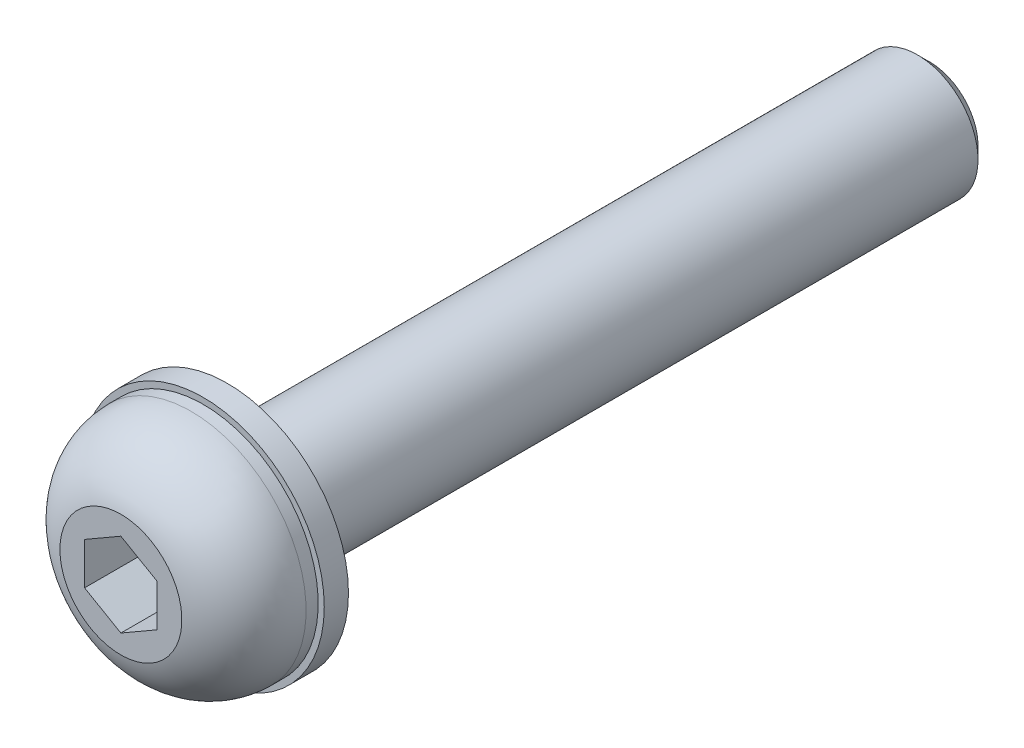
ISO-10303-21;
HEADER;
FILE_DESCRIPTION(('STEP AP214'),'2;1');
FILE_NAME('part.step','',(''),(''),'','','');
FILE_SCHEMA(('AUTOMOTIVE_DESIGN { 1 0 10303 214 1 1 1 1 }'));
ENDSEC;
DATA;
#1=APPLICATION_CONTEXT('core data for automotive mechanical design processes');
#2=APPLICATION_PROTOCOL_DEFINITION('international standard','automotive_design',2000,#1);
#3=PRODUCT_CONTEXT('',#1,'mechanical');
#4=PRODUCT('Part','Part','',(#3));
#5=PRODUCT_RELATED_PRODUCT_CATEGORY('part','',(#4));
#6=PRODUCT_DEFINITION_FORMATION('','',#4);
#7=PRODUCT_DEFINITION_CONTEXT('part definition',#1,'design');
#8=PRODUCT_DEFINITION('design','',#6,#7);
#9=PRODUCT_DEFINITION_SHAPE('','',#8);
#10=(LENGTH_UNIT() NAMED_UNIT(*) SI_UNIT(.MILLI.,.METRE.));
#11=(NAMED_UNIT(*) PLANE_ANGLE_UNIT() SI_UNIT($,.RADIAN.));
#12=(NAMED_UNIT(*) SI_UNIT($,.STERADIAN.) SOLID_ANGLE_UNIT());
#13=UNCERTAINTY_MEASURE_WITH_UNIT(LENGTH_MEASURE(1.E-05),#10,'distance_accuracy_value','');
#14=(GEOMETRIC_REPRESENTATION_CONTEXT(3) GLOBAL_UNCERTAINTY_ASSIGNED_CONTEXT((#13)) GLOBAL_UNIT_ASSIGNED_CONTEXT((#10,
#11,#12)) REPRESENTATION_CONTEXT('',''));
#15=CARTESIAN_POINT('',(0.,0.,0.));
#16=DIRECTION('',(0.,0.,1.));
#17=DIRECTION('',(1.,0.,0.));
#18=AXIS2_PLACEMENT_3D('',#15,#16,#17);
#19=CARTESIAN_POINT('',(0.,-1.73205080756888,1.4));
#20=DIRECTION('',(0.,0.,1.));
#21=DIRECTION('',(-1.,0.,0.));
#22=AXIS2_PLACEMENT_3D('',#19,#20,#21);
#23=PLANE('',#22);
#24=DIRECTION('',(0.86602540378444,-0.5,0.));
#25=VECTOR('',#24,1.);
#26=CARTESIAN_POINT('',(-1.5,-0.866025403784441,1.4));
#27=LINE('',#26,#25);
#28=CARTESIAN_POINT('',(-1.5,-0.866025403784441,1.4));
#29=VERTEX_POINT('',#28);
#30=CARTESIAN_POINT('',(0.,-1.73205080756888,1.4));
#31=VERTEX_POINT('',#30);
#32=EDGE_CURVE('E116',#29,#31,#27,.T.);
#33=ORIENTED_EDGE('',*,*,#32,.T.);
#34=DIRECTION('',(0.86602540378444,0.5,0.));
#35=VECTOR('',#34,1.);
#36=CARTESIAN_POINT('',(0.,-1.73205080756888,1.4));
#37=LINE('',#36,#35);
#38=CARTESIAN_POINT('',(1.5,-0.86602540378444,1.4));
#39=VERTEX_POINT('',#38);
#40=EDGE_CURVE('E98',#31,#39,#37,.T.);
#41=ORIENTED_EDGE('',*,*,#40,.T.);
#42=DIRECTION('',(0.,1.,0.));
#43=VECTOR('',#42,1.);
#44=CARTESIAN_POINT('',(1.5,-0.86602540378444,1.4));
#45=LINE('',#44,#43);
#46=CARTESIAN_POINT('',(1.5,0.86602540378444,1.4));
#47=VERTEX_POINT('',#46);
#48=EDGE_CURVE('E96',#39,#47,#45,.T.);
#49=ORIENTED_EDGE('',*,*,#48,.T.);
#50=DIRECTION('',(-0.86602540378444,0.5,0.));
#51=VECTOR('',#50,1.);
#52=CARTESIAN_POINT('',(1.5,0.86602540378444,1.4));
#53=LINE('',#52,#51);
#54=CARTESIAN_POINT('',(0.,1.73205080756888,1.4));
#55=VERTEX_POINT('',#54);
#56=EDGE_CURVE('E76',#47,#55,#53,.T.);
#57=ORIENTED_EDGE('',*,*,#56,.T.);
#58=DIRECTION('',(-0.86602540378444,-0.5,0.));
#59=VECTOR('',#58,1.);
#60=CARTESIAN_POINT('',(0.,1.73205080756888,1.4));
#61=LINE('',#60,#59);
#62=CARTESIAN_POINT('',(-1.5,0.86602540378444,1.4));
#63=VERTEX_POINT('',#62);
#64=EDGE_CURVE('E87',#55,#63,#61,.T.);
#65=ORIENTED_EDGE('',*,*,#64,.T.);
#66=DIRECTION('',(0.,-1.,0.));
#67=VECTOR('',#66,1.);
#68=CARTESIAN_POINT('',(-1.5,0.86602540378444,1.4));
#69=LINE('',#68,#67);
#70=EDGE_CURVE('E91',#63,#29,#69,.T.);
#71=ORIENTED_EDGE('',*,*,#70,.T.);
#72=EDGE_LOOP('',(#33,#41,#49,#57,#65,#71));
#73=FACE_BOUND('',#72,.T.);
#74=ADVANCED_FACE('F14',(#73),#23,.T.);
#75=CARTESIAN_POINT('',(1.5,-0.86602540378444,1.4));
#76=DIRECTION('',(1.,0.,0.));
#77=DIRECTION('',(0.,1.,0.));
#78=AXIS2_PLACEMENT_3D('',#75,#76,#77);
#79=PLANE('',#78);
#80=DIRECTION('',(0.,1.,0.));
#81=VECTOR('',#80,1.);
#82=CARTESIAN_POINT('',(1.5,-0.86602540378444,4.4));
#83=LINE('',#82,#81);
#84=CARTESIAN_POINT('',(1.5,-0.86602540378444,4.4));
#85=VERTEX_POINT('',#84);
#86=CARTESIAN_POINT('',(1.5,0.86602540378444,4.4));
#87=VERTEX_POINT('',#86);
#88=EDGE_CURVE('E108',#85,#87,#83,.T.);
#89=ORIENTED_EDGE('',*,*,#88,.T.);
#90=DIRECTION('',(0.,0.,1.));
#91=VECTOR('',#90,1.);
#92=CARTESIAN_POINT('',(1.5,0.86602540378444,1.4));
#93=LINE('',#92,#91);
#94=EDGE_CURVE('E84',#47,#87,#93,.T.);
#95=ORIENTED_EDGE('',*,*,#94,.F.);
#96=ORIENTED_EDGE('',*,*,#48,.F.);
#97=DIRECTION('',(0.,0.,1.));
#98=VECTOR('',#97,1.);
#99=CARTESIAN_POINT('',(1.5,-0.86602540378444,1.4));
#100=LINE('',#99,#98);
#101=EDGE_CURVE('E121',#39,#85,#100,.T.);
#102=ORIENTED_EDGE('',*,*,#101,.T.);
#103=EDGE_LOOP('',(#89,#95,#96,#102));
#104=FACE_BOUND('',#103,.T.);
#105=ADVANCED_FACE('F176',(#104),#79,.F.);
#106=CARTESIAN_POINT('',(1.5,0.86602540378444,1.4));
#107=DIRECTION('',(0.5,0.86602540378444,0.));
#108=DIRECTION('',(-0.86602540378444,0.5,0.));
#109=AXIS2_PLACEMENT_3D('',#106,#107,#108);
#110=PLANE('',#109);
#111=DIRECTION('',(-0.86602540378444,0.5,0.));
#112=VECTOR('',#111,1.);
#113=CARTESIAN_POINT('',(1.5,0.86602540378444,4.4));
#114=LINE('',#113,#112);
#115=CARTESIAN_POINT('',(0.,1.73205080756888,4.4));
#116=VERTEX_POINT('',#115);
#117=EDGE_CURVE('E79',#87,#116,#114,.T.);
#118=ORIENTED_EDGE('',*,*,#117,.T.);
#119=DIRECTION('',(0.,0.,1.));
#120=VECTOR('',#119,1.);
#121=CARTESIAN_POINT('',(0.,1.73205080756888,1.4));
#122=LINE('',#121,#120);
#123=EDGE_CURVE('E72',#55,#116,#122,.T.);
#124=ORIENTED_EDGE('',*,*,#123,.F.);
#125=ORIENTED_EDGE('',*,*,#56,.F.);
#126=ORIENTED_EDGE('',*,*,#94,.T.);
#127=EDGE_LOOP('',(#118,#124,#125,#126));
#128=FACE_BOUND('',#127,.T.);
#129=ADVANCED_FACE('F74',(#128),#110,.F.);
#130=CARTESIAN_POINT('',(0.,1.73205080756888,1.4));
#131=DIRECTION('',(-0.5,0.86602540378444,0.));
#132=DIRECTION('',(-0.86602540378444,-0.5,0.));
#133=AXIS2_PLACEMENT_3D('',#130,#131,#132);
#134=PLANE('',#133);
#135=DIRECTION('',(-0.86602540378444,-0.5,0.));
#136=VECTOR('',#135,1.);
#137=CARTESIAN_POINT('',(0.,1.73205080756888,4.4));
#138=LINE('',#137,#136);
#139=CARTESIAN_POINT('',(-1.5,0.86602540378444,4.4));
#140=VERTEX_POINT('',#139);
#141=EDGE_CURVE('E112',#116,#140,#138,.T.);
#142=ORIENTED_EDGE('',*,*,#141,.T.);
#143=DIRECTION('',(0.,0.,1.));
#144=VECTOR('',#143,1.);
#145=CARTESIAN_POINT('',(-1.5,0.86602540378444,1.4));
#146=LINE('',#145,#144);
#147=EDGE_CURVE('E83',#63,#140,#146,.T.);
#148=ORIENTED_EDGE('',*,*,#147,.F.);
#149=ORIENTED_EDGE('',*,*,#64,.F.);
#150=ORIENTED_EDGE('',*,*,#123,.T.);
#151=EDGE_LOOP('',(#142,#148,#149,#150));
#152=FACE_BOUND('',#151,.T.);
#153=ADVANCED_FACE('F88',(#152),#134,.F.);
#154=CARTESIAN_POINT('',(-1.5,0.86602540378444,1.4));
#155=DIRECTION('',(-1.,0.,0.));
#156=DIRECTION('',(0.,-1.,0.));
#157=AXIS2_PLACEMENT_3D('',#154,#155,#156);
#158=PLANE('',#157);
#159=DIRECTION('',(0.,-1.,0.));
#160=VECTOR('',#159,1.);
#161=CARTESIAN_POINT('',(-1.5,0.86602540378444,4.4));
#162=LINE('',#161,#160);
#163=CARTESIAN_POINT('',(-1.5,-0.866025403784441,4.4));
#164=VERTEX_POINT('',#163);
#165=EDGE_CURVE('E114',#140,#164,#162,.T.);
#166=ORIENTED_EDGE('',*,*,#165,.T.);
#167=DIRECTION('',(0.,0.,1.));
#168=VECTOR('',#167,1.);
#169=CARTESIAN_POINT('',(-1.5,-0.866025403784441,1.4));
#170=LINE('',#169,#168);
#171=EDGE_CURVE('E39',#29,#164,#170,.T.);
#172=ORIENTED_EDGE('',*,*,#171,.F.);
#173=ORIENTED_EDGE('',*,*,#70,.F.);
#174=ORIENTED_EDGE('',*,*,#147,.T.);
#175=EDGE_LOOP('',(#166,#172,#173,#174));
#176=FACE_BOUND('',#175,.T.);
#177=ADVANCED_FACE('F185',(#176),#158,.F.);
#178=CARTESIAN_POINT('',(-1.5,-0.866025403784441,1.4));
#179=DIRECTION('',(-0.5,-0.86602540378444,0.));
#180=DIRECTION('',(0.866025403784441,-0.5,0.));
#181=AXIS2_PLACEMENT_3D('',#178,#179,#180);
#182=PLANE('',#181);
#183=DIRECTION('',(0.86602540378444,-0.5,0.));
#184=VECTOR('',#183,1.);
#185=CARTESIAN_POINT('',(-1.5,-0.866025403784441,4.4));
#186=LINE('',#185,#184);
#187=CARTESIAN_POINT('',(0.,-1.73205080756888,4.4));
#188=VERTEX_POINT('',#187);
#189=EDGE_CURVE('E31',#164,#188,#186,.T.);
#190=ORIENTED_EDGE('',*,*,#189,.T.);
#191=DIRECTION('',(0.,0.,1.));
#192=VECTOR('',#191,1.);
#193=CARTESIAN_POINT('',(0.,-1.73205080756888,1.4));
#194=LINE('',#193,#192);
#195=EDGE_CURVE('E61',#31,#188,#194,.T.);
#196=ORIENTED_EDGE('',*,*,#195,.F.);
#197=ORIENTED_EDGE('',*,*,#32,.F.);
#198=ORIENTED_EDGE('',*,*,#171,.T.);
#199=EDGE_LOOP('',(#190,#196,#197,#198));
#200=FACE_BOUND('',#199,.T.);
#201=ADVANCED_FACE('F188',(#200),#182,.F.);
#202=CARTESIAN_POINT('',(0.,-1.73205080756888,1.4));
#203=DIRECTION('',(0.5,-0.86602540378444,0.));
#204=DIRECTION('',(0.86602540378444,0.5,0.));
#205=AXIS2_PLACEMENT_3D('',#202,#203,#204);
#206=PLANE('',#205);
#207=DIRECTION('',(0.86602540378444,0.5,0.));
#208=VECTOR('',#207,1.);
#209=CARTESIAN_POINT('',(0.,-1.73205080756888,4.4));
#210=LINE('',#209,#208);
#211=EDGE_CURVE('E104',#188,#85,#210,.T.);
#212=ORIENTED_EDGE('',*,*,#211,.T.);
#213=ORIENTED_EDGE('',*,*,#101,.F.);
#214=ORIENTED_EDGE('',*,*,#40,.F.);
#215=ORIENTED_EDGE('',*,*,#195,.T.);
#216=EDGE_LOOP('',(#212,#213,#214,#215));
#217=FACE_BOUND('',#216,.T.);
#218=ADVANCED_FACE('F193',(#217),#206,.F.);
#219=CARTESIAN_POINT('',(0.,0.,4.4));
#220=DIRECTION('',(0.,0.,-1.));
#221=DIRECTION('',(1.,0.,0.));
#222=AXIS2_PLACEMENT_3D('',#219,#220,#221);
#223=PLANE('',#222);
#224=ORIENTED_EDGE('',*,*,#211,.F.);
#225=ORIENTED_EDGE('',*,*,#189,.F.);
#226=ORIENTED_EDGE('',*,*,#165,.F.);
#227=ORIENTED_EDGE('',*,*,#141,.F.);
#228=ORIENTED_EDGE('',*,*,#117,.F.);
#229=ORIENTED_EDGE('',*,*,#88,.F.);
#230=EDGE_LOOP('',(#224,#225,#226,#227,#228,#229));
#231=FACE_BOUND('',#230,.T.);
#232=CARTESIAN_POINT('',(0.,0.,4.4));
#233=DIRECTION('',(0.,0.,1.));
#234=DIRECTION('',(-1.,0.,0.));
#235=AXIS2_PLACEMENT_3D('',#232,#233,#234);
#236=CIRCLE('',#235,2.51811457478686);
#237=CARTESIAN_POINT('',(-2.51811457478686,0.,4.4));
#238=VERTEX_POINT('',#237);
#239=EDGE_CURVE('E126',#238,#238,#236,.T.);
#240=ORIENTED_EDGE('',*,*,#239,.T.);
#241=EDGE_LOOP('',(#240));
#242=FACE_BOUND('',#241,.T.);
#243=ADVANCED_FACE('F196',(#231,#242),#223,.F.);
#244=CARTESIAN_POINT('',(0.,0.,1.5));
#245=DIRECTION('',(0.,0.,1.));
#246=DIRECTION('',(-1.,0.,0.));
#247=AXIS2_PLACEMENT_3D('',#244,#245,#246);
#248=DEGENERATE_TOROIDAL_SURFACE('',#247,1.75,3.,.T.);
#249=ORIENTED_EDGE('',*,*,#239,.F.);
#250=EDGE_LOOP('',(#249));
#251=FACE_BOUND('',#250,.T.);
#252=CARTESIAN_POINT('',(0.,0.,1.5));
#253=DIRECTION('',(0.,0.,1.));
#254=DIRECTION('',(-1.,0.,0.));
#255=AXIS2_PLACEMENT_3D('',#252,#253,#254);
#256=CIRCLE('',#255,4.75);
#257=CARTESIAN_POINT('',(-4.75,0.,1.5));
#258=VERTEX_POINT('',#257);
#259=EDGE_CURVE('E129',#258,#258,#256,.T.);
#260=ORIENTED_EDGE('',*,*,#259,.T.);
#261=EDGE_LOOP('',(#260));
#262=FACE_BOUND('',#261,.T.);
#263=ADVANCED_FACE('F209',(#251,#262),#248,.T.);
#264=CARTESIAN_POINT('',(0.,0.,4.4));
#265=DIRECTION('',(0.,0.,1.));
#266=DIRECTION('',(-1.,0.,0.));
#267=AXIS2_PLACEMENT_3D('',#264,#265,#266);
#268=CYLINDRICAL_SURFACE('',#267,4.75);
#269=ORIENTED_EDGE('',*,*,#259,.F.);
#270=EDGE_LOOP('',(#269));
#271=FACE_BOUND('',#270,.T.);
#272=CARTESIAN_POINT('',(0.,0.,1.));
#273=DIRECTION('',(0.,0.,1.));
#274=DIRECTION('',(-1.,0.,0.));
#275=AXIS2_PLACEMENT_3D('',#272,#273,#274);
#276=CIRCLE('',#275,4.75);
#277=CARTESIAN_POINT('',(-4.75,0.,1.));
#278=VERTEX_POINT('',#277);
#279=EDGE_CURVE('E132',#278,#278,#276,.T.);
#280=ORIENTED_EDGE('',*,*,#279,.T.);
#281=EDGE_LOOP('',(#280));
#282=FACE_BOUND('',#281,.T.);
#283=ADVANCED_FACE('F172',(#271,#282),#268,.T.);
#284=CARTESIAN_POINT('',(2.5,0.,1.));
#285=DIRECTION('',(0.,0.,1.));
#286=DIRECTION('',(-1.,0.,0.));
#287=AXIS2_PLACEMENT_3D('',#284,#285,#286);
#288=PLANE('',#287);
#289=CARTESIAN_POINT('',(0.,0.,1.));
#290=DIRECTION('',(0.,0.,1.));
#291=DIRECTION('',(1.,0.,0.));
#292=AXIS2_PLACEMENT_3D('',#289,#290,#291);
#293=CIRCLE('',#292,2.65);
#294=CARTESIAN_POINT('',(2.65,0.,1.));
#295=VERTEX_POINT('',#294);
#296=EDGE_CURVE('E9',#295,#295,#293,.F.);
#297=ORIENTED_EDGE('',*,*,#296,.T.);
#298=EDGE_LOOP('',(#297));
#299=FACE_BOUND('',#298,.T.);
#300=CARTESIAN_POINT('',(0.,0.,1.));
#301=DIRECTION('',(0.,0.,1.));
#302=DIRECTION('',(-1.,0.,0.));
#303=AXIS2_PLACEMENT_3D('',#300,#301,#302);
#304=CIRCLE('',#303,2.5);
#305=CARTESIAN_POINT('',(-2.5,0.,1.));
#306=VERTEX_POINT('',#305);
#307=EDGE_CURVE('E118',#306,#306,#304,.T.);
#308=ORIENTED_EDGE('',*,*,#307,.T.);
#309=EDGE_LOOP('',(#308));
#310=FACE_BOUND('',#309,.T.);
#311=ADVANCED_FACE('F160',(#299,#310),#288,.F.);
#312=CARTESIAN_POINT('',(2.5,0.,-29.));
#313=DIRECTION('',(0.,0.,1.));
#314=DIRECTION('',(-1.,0.,0.));
#315=AXIS2_PLACEMENT_3D('',#312,#313,#314);
#316=PLANE('',#315);
#317=CARTESIAN_POINT('',(0.,0.,-29.));
#318=DIRECTION('',(0.,0.,1.));
#319=DIRECTION('',(-1.,0.,0.));
#320=AXIS2_PLACEMENT_3D('',#317,#318,#319);
#321=CIRCLE('',#320,2.);
#322=CARTESIAN_POINT('',(-2.,0.,-29.));
#323=VERTEX_POINT('',#322);
#324=EDGE_CURVE('E23',#323,#323,#321,.F.);
#325=ORIENTED_EDGE('',*,*,#324,.T.);
#326=EDGE_LOOP('',(#325));
#327=FACE_BOUND('',#326,.T.);
#328=ADVANCED_FACE('F171',(#327),#316,.F.);
#329=CARTESIAN_POINT('',(0.,0.,4.4));
#330=DIRECTION('',(0.,0.,1.));
#331=DIRECTION('',(-1.,0.,0.));
#332=AXIS2_PLACEMENT_3D('',#329,#330,#331);
#333=CYLINDRICAL_SURFACE('',#332,2.5);
#334=CARTESIAN_POINT('',(0.,0.,-28.5));
#335=DIRECTION('',(0.,0.,1.));
#336=DIRECTION('',(-1.,0.,0.));
#337=AXIS2_PLACEMENT_3D('',#334,#335,#336);
#338=CIRCLE('',#337,2.5);
#339=CARTESIAN_POINT('',(-2.5,0.,-28.5));
#340=VERTEX_POINT('',#339);
#341=EDGE_CURVE('E135',#340,#340,#338,.T.);
#342=ORIENTED_EDGE('',*,*,#341,.T.);
#343=EDGE_LOOP('',(#342));
#344=FACE_BOUND('',#343,.T.);
#345=ORIENTED_EDGE('',*,*,#307,.F.);
#346=EDGE_LOOP('',(#345));
#347=FACE_BOUND('',#346,.T.);
#348=ADVANCED_FACE('F200',(#344,#347),#333,.T.);
#349=CARTESIAN_POINT('',(0.,0.,-28.5));
#350=DIRECTION('',(0.,0.,1.));
#351=DIRECTION('',(-1.,0.,0.));
#352=AXIS2_PLACEMENT_3D('',#349,#350,#351);
#353=CONICAL_SURFACE('',#352,2.5,0.785398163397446);
#354=ORIENTED_EDGE('',*,*,#324,.F.);
#355=EDGE_LOOP('',(#354));
#356=FACE_BOUND('',#355,.T.);
#357=ORIENTED_EDGE('',*,*,#341,.F.);
#358=EDGE_LOOP('',(#357));
#359=FACE_BOUND('',#358,.T.);
#360=ADVANCED_FACE('F153',(#356,#359),#353,.T.);
#361=CARTESIAN_POINT('',(0.,0.,0.));
#362=DIRECTION('',(0.,0.,1.));
#363=DIRECTION('',(1.,0.,0.));
#364=AXIS2_PLACEMENT_3D('',#361,#362,#363);
#365=PLANE('',#364);
#366=CARTESIAN_POINT('',(0.,0.,0.));
#367=DIRECTION('',(0.,0.,1.));
#368=DIRECTION('',(1.,0.,0.));
#369=AXIS2_PLACEMENT_3D('',#366,#367,#368);
#370=CIRCLE('',#369,5.);
#371=CARTESIAN_POINT('',(5.,0.,0.));
#372=VERTEX_POINT('',#371);
#373=EDGE_CURVE('E18',#372,#372,#370,.T.);
#374=ORIENTED_EDGE('',*,*,#373,.F.);
#375=EDGE_LOOP('',(#374));
#376=FACE_BOUND('',#375,.T.);
#377=CARTESIAN_POINT('',(0.,0.,0.));
#378=DIRECTION('',(0.,0.,1.));
#379=DIRECTION('',(1.,0.,0.));
#380=AXIS2_PLACEMENT_3D('',#377,#378,#379);
#381=CIRCLE('',#380,2.65);
#382=CARTESIAN_POINT('',(2.65,0.,0.));
#383=VERTEX_POINT('',#382);
#384=EDGE_CURVE('E140',#383,#383,#381,.T.);
#385=ORIENTED_EDGE('',*,*,#384,.T.);
#386=EDGE_LOOP('',(#385));
#387=FACE_BOUND('',#386,.T.);
#388=ADVANCED_FACE('F149',(#376,#387),#365,.F.);
#389=CARTESIAN_POINT('',(0.,0.,1.));
#390=DIRECTION('',(0.,0.,-1.));
#391=DIRECTION('',(-1.,0.,0.));
#392=AXIS2_PLACEMENT_3D('',#389,#390,#391);
#393=CYLINDRICAL_SURFACE('',#392,2.65);
#394=ORIENTED_EDGE('',*,*,#296,.F.);
#395=EDGE_LOOP('',(#394));
#396=FACE_BOUND('',#395,.T.);
#397=ORIENTED_EDGE('',*,*,#384,.F.);
#398=EDGE_LOOP('',(#397));
#399=FACE_BOUND('',#398,.T.);
#400=ADVANCED_FACE('F152',(#396,#399),#393,.F.);
#401=CARTESIAN_POINT('',(0.,0.,1.));
#402=DIRECTION('',(0.,0.,-1.));
#403=DIRECTION('',(-1.,0.,0.));
#404=AXIS2_PLACEMENT_3D('',#401,#402,#403);
#405=CYLINDRICAL_SURFACE('',#404,5.);
#406=CARTESIAN_POINT('',(0.,0.,1.));
#407=DIRECTION('',(0.,0.,1.));
#408=DIRECTION('',(1.,0.,0.));
#409=AXIS2_PLACEMENT_3D('',#406,#407,#408);
#410=CIRCLE('',#409,5.);
#411=CARTESIAN_POINT('',(5.,0.,1.));
#412=VERTEX_POINT('',#411);
#413=EDGE_CURVE('E105',#412,#412,#410,.T.);
#414=ORIENTED_EDGE('',*,*,#413,.F.);
#415=EDGE_LOOP('',(#414));
#416=FACE_BOUND('',#415,.T.);
#417=ORIENTED_EDGE('',*,*,#373,.T.);
#418=EDGE_LOOP('',(#417));
#419=FACE_BOUND('',#418,.T.);
#420=ADVANCED_FACE('F16',(#416,#419),#405,.T.);
#421=CARTESIAN_POINT('',(0.,0.,1.));
#422=DIRECTION('',(0.,0.,1.));
#423=DIRECTION('',(1.,0.,0.));
#424=AXIS2_PLACEMENT_3D('',#421,#422,#423);
#425=PLANE('',#424);
#426=ORIENTED_EDGE('',*,*,#413,.T.);
#427=EDGE_LOOP('',(#426));
#428=FACE_BOUND('',#427,.T.);
#429=ORIENTED_EDGE('',*,*,#279,.F.);
#430=EDGE_LOOP('',(#429));
#431=FACE_BOUND('',#430,.T.);
#432=ADVANCED_FACE('F154',(#428,#431),#425,.T.);
#433=CLOSED_SHELL('',(#74,#105,#129,#153,#177,#201,#218,#243,#263,#283,#311,#328,#348,#360,#388,
#400,#420,#432));
#434=MANIFOLD_SOLID_BREP('B1',#433);
#435=ADVANCED_BREP_SHAPE_REPRESENTATION('',(#18,#434),#14);
#436=SHAPE_DEFINITION_REPRESENTATION(#9,#435);
ENDSEC;
END-ISO-10303-21;
